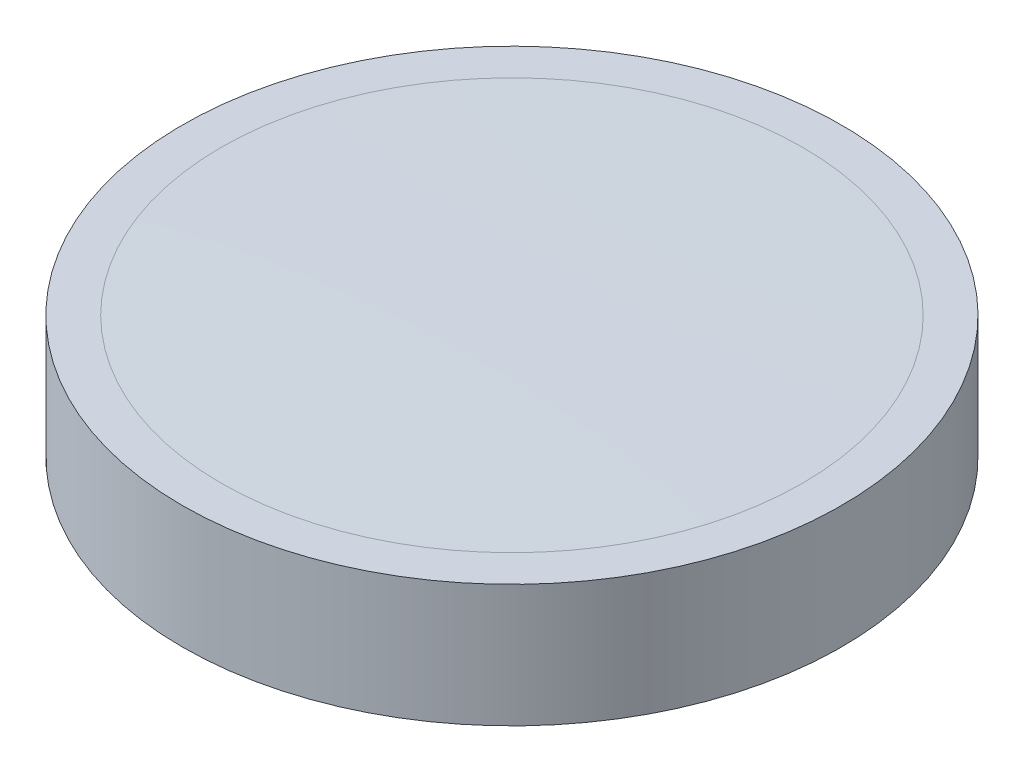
ISO-10303-21;
HEADER;
FILE_DESCRIPTION(('STEP AP214'),'2;1');
FILE_NAME('part.step','',(''),(''),'','','');
FILE_SCHEMA(('AUTOMOTIVE_DESIGN { 1 0 10303 214 1 1 1 1 }'));
ENDSEC;
DATA;
#1=APPLICATION_CONTEXT('core data for automotive mechanical design processes');
#2=APPLICATION_PROTOCOL_DEFINITION('international standard','automotive_design',2000,#1);
#3=PRODUCT_CONTEXT('',#1,'mechanical');
#4=PRODUCT('Part','Part','',(#3));
#5=PRODUCT_RELATED_PRODUCT_CATEGORY('part','',(#4));
#6=PRODUCT_DEFINITION_FORMATION('','',#4);
#7=PRODUCT_DEFINITION_CONTEXT('part definition',#1,'design');
#8=PRODUCT_DEFINITION('design','',#6,#7);
#9=PRODUCT_DEFINITION_SHAPE('','',#8);
#10=(LENGTH_UNIT() NAMED_UNIT(*) SI_UNIT(.MILLI.,.METRE.));
#11=(NAMED_UNIT(*) PLANE_ANGLE_UNIT() SI_UNIT($,.RADIAN.));
#12=(NAMED_UNIT(*) SI_UNIT($,.STERADIAN.) SOLID_ANGLE_UNIT());
#13=UNCERTAINTY_MEASURE_WITH_UNIT(LENGTH_MEASURE(1.E-05),#10,'distance_accuracy_value','');
#14=(GEOMETRIC_REPRESENTATION_CONTEXT(3) GLOBAL_UNCERTAINTY_ASSIGNED_CONTEXT((#13)) GLOBAL_UNIT_ASSIGNED_CONTEXT((#10,
#11,#12)) REPRESENTATION_CONTEXT('',''));
#15=CARTESIAN_POINT('',(0.,0.,0.));
#16=DIRECTION('',(0.,0.,1.));
#17=DIRECTION('',(1.,0.,0.));
#18=AXIS2_PLACEMENT_3D('',#15,#16,#17);
#19=CARTESIAN_POINT('',(-3.93,16.1,30.));
#20=CARTESIAN_POINT('',(-3.93,16.1,29.98015872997));
#21=CARTESIAN_POINT('',(-3.93,16.09999446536,29.94047618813));
#22=CARTESIAN_POINT('',(-3.93,16.09996956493,29.88095237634));
#23=CARTESIAN_POINT('',(-3.93,16.09992808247,29.82142856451));
#24=CARTESIAN_POINT('',(-3.93,16.0998700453,29.76190475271));
#25=CARTESIAN_POINT('',(-3.93,16.09979549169,29.70238094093));
#26=CARTESIAN_POINT('',(-3.93,16.09970447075,29.64285712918));
#27=CARTESIAN_POINT('',(-3.93,16.09959704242,29.58333331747));
#28=CARTESIAN_POINT('',(-3.93,16.09947327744,29.5238095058));
#29=CARTESIAN_POINT('',(-3.93,16.09933325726,29.46428569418));
#30=CARTESIAN_POINT('',(-3.93,16.09917707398,29.40476188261));
#31=CARTESIAN_POINT('',(-3.93,16.09900483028,29.3452380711));
#32=CARTESIAN_POINT('',(-3.93,16.09881663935,29.28571425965));
#33=CARTESIAN_POINT('',(-3.93,16.09861262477,29.22619044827));
#34=CARTESIAN_POINT('',(-3.93,16.09839292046,29.16666663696));
#35=CARTESIAN_POINT('',(-3.93,16.09815767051,29.10714282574));
#36=CARTESIAN_POINT('',(-3.93,16.09790702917,29.04761901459));
#37=CARTESIAN_POINT('',(-3.93,16.09764116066,28.98809520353));
#38=CARTESIAN_POINT('',(-3.93,16.0973602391,28.92857139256));
#39=CARTESIAN_POINT('',(-3.93,16.09706444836,28.86904758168));
#40=CARTESIAN_POINT('',(-3.93,16.09675398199,28.8095237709));
#41=CARTESIAN_POINT('',(-3.93,16.09642904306,28.74999996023));
#42=CARTESIAN_POINT('',(-3.93,16.09608984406,28.69047614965));
#43=CARTESIAN_POINT('',(-3.93,16.09573660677,28.63095233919));
#44=CARTESIAN_POINT('',(-3.93,16.09536956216,28.57142852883));
#45=CARTESIAN_POINT('',(-3.93,16.09498895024,28.51190471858));
#46=CARTESIAN_POINT('',(-3.93,16.09459501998,28.45238090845));
#47=CARTESIAN_POINT('',(-3.93,16.09418802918,28.39285709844));
#48=CARTESIAN_POINT('',(-3.93,16.09376824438,28.33333328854));
#49=CARTESIAN_POINT('',(-3.93,16.09333594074,28.27380947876));
#50=CARTESIAN_POINT('',(-3.93,16.09289140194,28.2142856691));
#51=CARTESIAN_POINT('',(-3.93,16.0924349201,28.15476185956));
#52=CARTESIAN_POINT('',(-3.93,16.09196679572,28.09523805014));
#53=CARTESIAN_POINT('',(-3.93,16.09148733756,28.03571424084));
#54=CARTESIAN_POINT('',(-3.93,16.09099686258,27.97619043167));
#55=CARTESIAN_POINT('',(-3.93,16.09049569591,27.91666662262));
#56=CARTESIAN_POINT('',(-3.93,16.08998417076,27.85714281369));
#57=CARTESIAN_POINT('',(-3.93,16.08946262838,27.79761900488));
#58=CARTESIAN_POINT('',(-3.93,16.08893141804,27.73809519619));
#59=CARTESIAN_POINT('',(-3.93,16.08839089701,27.67857138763));
#60=CARTESIAN_POINT('',(-3.93,16.08784143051,27.61904757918));
#61=CARTESIAN_POINT('',(-3.93,16.08728339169,27.55952377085));
#62=CARTESIAN_POINT('',(-3.93,16.08671716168,27.49999996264));
#63=CARTESIAN_POINT('',(-3.93,16.08614312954,27.44047615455));
#64=CARTESIAN_POINT('',(-3.93,16.08556169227,27.38095234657));
#65=CARTESIAN_POINT('',(-3.93,16.08497325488,27.32142853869));
#66=CARTESIAN_POINT('',(-3.93,16.08437823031,27.26190473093));
#67=CARTESIAN_POINT('',(-3.93,16.08377703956,27.20238092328));
#68=CARTESIAN_POINT('',(-3.93,16.08317011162,27.14285711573));
#69=CARTESIAN_POINT('',(-3.93,16.08255788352,27.08333330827));
#70=CARTESIAN_POINT('',(-3.93,16.08194080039,27.02380950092));
#71=CARTESIAN_POINT('',(-3.93,16.08131931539,26.96428569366));
#72=CARTESIAN_POINT('',(-3.93,16.08069388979,26.90476188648));
#73=CARTESIAN_POINT('',(-3.93,16.08006499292,26.84523807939));
#74=CARTESIAN_POINT('',(-3.93,16.07943310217,26.78571427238));
#75=CARTESIAN_POINT('',(-3.93,16.07879870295,26.72619046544));
#76=CARTESIAN_POINT('',(-3.93,16.07816228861,26.66666665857));
#77=CARTESIAN_POINT('',(-3.93,16.07752436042,26.60714285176));
#78=CARTESIAN_POINT('',(-3.93,16.07688542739,26.547619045));
#79=CARTESIAN_POINT('',(-3.93,16.07624600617,26.48809523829));
#80=CARTESIAN_POINT('',(-3.93,16.07560662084,26.42857143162));
#81=CARTESIAN_POINT('',(-3.93,16.07496780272,26.36904762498));
#82=CARTESIAN_POINT('',(-3.93,16.07433009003,26.30952381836));
#83=CARTESIAN_POINT('',(-3.93,16.07363890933,26.24484194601));
#84=CARTESIAN_POINT('',(-3.93,16.07316162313,26.20000132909));
#85=CARTESIAN_POINT('',(-3.93,16.07289629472,26.17500198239));
#86=(BOUNDED_CURVE() B_SPLINE_CURVE(3,(#19,#20,#21,#22,#23,#24,#25,#26,#27,#28,#29,#30,#31,#32,
#33,#34,#35,#36,#37,#38,#39,#40,#41,#42,#43,#44,#45,#46,#47,#48,#49,#50,#51,#52,#53,#54,#55,#56,
#57,#58,#59,#60,#61,#62,#63,#64,#65,#66,#67,#68,#69,#70,#71,#72,#73,#74,#75,#76,#77,#78,#79,#80,
#81,#82,#83,#84,#85),.UNSPECIFIED.,.F.,.F.) B_SPLINE_CURVE_WITH_KNOTS((4,1,1,1,1,1,1,1,1,1,1,1,
1,1,1,1,1,1,1,1,1,1,1,1,1,1,1,1,1,1,1,1,1,1,1,1,1,1,1,1,1,1,1,1,1,1,1,1,1,1,1,1,1,1,1,1,1,1,1,1,
1,1,1,1,4),(0.,0.01556131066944,0.03112262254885,0.04668393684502,0.06224525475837,
0.07780657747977,0.09336790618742,0.1089292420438,0.1244905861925,0.1400519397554,
0.1556133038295,0.1711746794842,0.1867360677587,0.2022974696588,0.2178588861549,0.2334203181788,
0.248981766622,0.2645432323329,0.2801047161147,0.2956662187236,0.3112277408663,0.3267892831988,
0.3423508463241,0.357912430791,0.3734740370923,0.3890356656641,0.4045973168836,0.4201589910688,
0.4357206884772,0.451282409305,0.4668441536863,0.4824059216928,0.4979677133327,0.5135295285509,
0.5290913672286,0.5446532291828,0.5602151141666,0.5757770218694,0.5913389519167,0.6069009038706,
0.6224628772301,0.6380248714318,0.6535868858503,0.6691489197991,0.6847109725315,0.7002730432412,
0.715835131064,0.7313972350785,0.7469593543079,0.7625214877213,0.7780836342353,0.7936457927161,
0.8092079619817,0.8247701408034,0.8403323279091,0.8558945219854,0.8714567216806,0.8870189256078,
0.9025811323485,0.918143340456,0.9337055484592,0.9492677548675,0.9648299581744,0.9803921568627,
1.),.UNSPECIFIED.) CURVE() GEOMETRIC_REPRESENTATION_ITEM() RATIONAL_B_SPLINE_CURVE((1.,1.,1.,1.,
1.,1.,1.,1.,1.,1.,1.,1.,1.,1.,1.,1.,1.,1.,1.,1.,1.,1.,1.,1.,1.,1.,1.,1.,1.,1.,1.,1.,1.,1.,1.,1.,
1.,1.,1.,1.,1.,1.,1.,1.,1.,1.,1.,1.,1.,1.,1.,1.,1.,1.,1.,1.,1.,1.,1.,1.,1.,1.,1.,1.,1.,1.,1.)) REPRESENTATION_ITEM(''));
#87=CARTESIAN_POINT('',(-3.93,16.1,30.));
#88=DIRECTION('',(0.,1.,0.));
#89=AXIS1_PLACEMENT('',#87,#88);
#90=SURFACE_OF_REVOLUTION('',#86,#89);
#91=CARTESIAN_POINT('',(-3.93,16.1,30.));
#92=VERTEX_POINT('',#91);
#93=VERTEX_LOOP('',#92);
#94=FACE_BOUND('',#93,.T.);
#95=CARTESIAN_POINT('',(-3.93,16.0736943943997,30.));
#96=DIRECTION('',(0.,1.,0.));
#97=DIRECTION('',(0.,0.,1.));
#98=AXIS2_PLACEMENT_3D('',#95,#96,#97);
#99=CIRCLE('',#98,3.75);
#100=CARTESIAN_POINT('',(-3.93,16.0736943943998,26.25));
#101=VERTEX_POINT('',#100);
#102=CARTESIAN_POINT('',(-3.93000000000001,16.0736943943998,33.75));
#103=VERTEX_POINT('',#102);
#104=EDGE_CURVE('E45',#101,#103,#99,.F.);
#105=ORIENTED_EDGE('',*,*,#104,.F.);
#106=CARTESIAN_POINT('',(-3.93,16.0736943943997,30.));
#107=DIRECTION('',(0.,1.,0.));
#108=DIRECTION('',(0.,0.,-1.));
#109=AXIS2_PLACEMENT_3D('',#106,#107,#108);
#110=CIRCLE('',#109,3.75);
#111=EDGE_CURVE('E48',#103,#101,#110,.F.);
#112=ORIENTED_EDGE('',*,*,#111,.F.);
#113=EDGE_LOOP('',(#105,#112));
#114=FACE_BOUND('',#113,.T.);
#115=ADVANCED_FACE('F17',(#94,#114),#90,.F.);
#116=CARTESIAN_POINT('',(-3.93,16.0736943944,23.7033));
#117=DIRECTION('',(0.,1.,0.));
#118=DIRECTION('',(0.,0.,1.));
#119=AXIS2_PLACEMENT_3D('',#116,#117,#118);
#120=PLANE('',#119);
#121=ORIENTED_EDGE('',*,*,#111,.T.);
#122=ORIENTED_EDGE('',*,*,#104,.T.);
#123=EDGE_LOOP('',(#121,#122));
#124=FACE_BOUND('',#123,.T.);
#125=CARTESIAN_POINT('',(-3.93,16.0736943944,30.));
#126=DIRECTION('',(0.,1.,0.));
#127=DIRECTION('',(0.,0.,1.));
#128=AXIS2_PLACEMENT_3D('',#125,#126,#127);
#129=CIRCLE('',#128,4.25);
#130=CARTESIAN_POINT('',(-3.93,16.0736943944,34.25));
#131=VERTEX_POINT('',#130);
#132=EDGE_CURVE('E51',#131,#131,#129,.F.);
#133=ORIENTED_EDGE('',*,*,#132,.F.);
#134=EDGE_LOOP('',(#133));
#135=FACE_BOUND('',#134,.T.);
#136=ADVANCED_FACE('F43',(#124,#135),#120,.T.);
#137=CARTESIAN_POINT('',(-3.93,14.4788783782,30.));
#138=DIRECTION('',(0.,1.,0.));
#139=DIRECTION('',(0.,0.,1.));
#140=AXIS2_PLACEMENT_3D('',#137,#138,#139);
#141=CYLINDRICAL_SURFACE('',#140,4.25);
#142=CARTESIAN_POINT('',(-3.93,14.49276109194,30.));
#143=DIRECTION('',(0.,1.,0.));
#144=DIRECTION('',(0.,0.,1.));
#145=AXIS2_PLACEMENT_3D('',#142,#143,#144);
#146=CIRCLE('',#145,4.25);
#147=CARTESIAN_POINT('',(-3.93,14.49276109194,34.25));
#148=VERTEX_POINT('',#147);
#149=EDGE_CURVE('E29',#148,#148,#146,.F.);
#150=ORIENTED_EDGE('',*,*,#149,.F.);
#151=EDGE_LOOP('',(#150));
#152=FACE_BOUND('',#151,.T.);
#153=ORIENTED_EDGE('',*,*,#132,.T.);
#154=EDGE_LOOP('',(#153));
#155=FACE_BOUND('',#154,.T.);
#156=ADVANCED_FACE('F71',(#152,#155),#141,.T.);
#157=CARTESIAN_POINT('',(-3.93,14.49276109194,36.4217));
#158=DIRECTION('',(0.,-1.,0.));
#159=DIRECTION('',(0.,0.,-1.));
#160=AXIS2_PLACEMENT_3D('',#157,#158,#159);
#161=PLANE('',#160);
#162=CARTESIAN_POINT('',(-3.93,14.49276109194,30.));
#163=DIRECTION('',(0.,-1.,0.));
#164=DIRECTION('',(0.,0.,-1.));
#165=AXIS2_PLACEMENT_3D('',#162,#163,#164);
#166=CIRCLE('',#165,4.00000000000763);
#167=CARTESIAN_POINT('',(-3.93,14.49276109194,25.9999999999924));
#168=VERTEX_POINT('',#167);
#169=EDGE_CURVE('E11',#168,#168,#166,.T.);
#170=ORIENTED_EDGE('',*,*,#169,.F.);
#171=EDGE_LOOP('',(#170));
#172=FACE_BOUND('',#171,.T.);
#173=ORIENTED_EDGE('',*,*,#149,.T.);
#174=EDGE_LOOP('',(#173));
#175=FACE_BOUND('',#174,.T.);
#176=ADVANCED_FACE('F88',(#172,#175),#161,.T.);
#177=CARTESIAN_POINT('',(-3.93,13.6,30.));
#178=CARTESIAN_POINT('',(-3.93,13.6,30.02116414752));
#179=CARTESIAN_POINT('',(-3.93,13.60014627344,30.06349359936));
#180=CARTESIAN_POINT('',(-3.93,13.60080451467,30.1269871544));
#181=CARTESIAN_POINT('',(-3.93,13.60190163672,30.19048074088));
#182=CARTESIAN_POINT('',(-3.93,13.60343771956,30.25397431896));
#183=CARTESIAN_POINT('',(-3.93,13.60541287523,30.31746789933));
#184=CARTESIAN_POINT('',(-3.93,13.6078272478,30.38096147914));
#185=CARTESIAN_POINT('',(-3.93,13.61068101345,30.44445505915));
#186=CARTESIAN_POINT('',(-3.93,13.61397438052,30.50794863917));
#187=CARTESIAN_POINT('',(-3.93,13.61770758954,30.57144221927));
#188=CARTESIAN_POINT('',(-3.93,13.62188091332,30.63493579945));
#189=CARTESIAN_POINT('',(-3.93,13.62649465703,30.6984293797));
#190=CARTESIAN_POINT('',(-3.93,13.63154915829,30.76192296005));
#191=CARTESIAN_POINT('',(-3.93,13.63704478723,30.82541654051));
#192=CARTESIAN_POINT('',(-3.93,13.64298194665,30.88891012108));
#193=CARTESIAN_POINT('',(-3.93,13.64936107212,30.95240370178));
#194=CARTESIAN_POINT('',(-3.93,13.65618263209,31.01589728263));
#195=CARTESIAN_POINT('',(-3.93,13.66344712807,31.07939086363));
#196=CARTESIAN_POINT('',(-3.93,13.67115509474,31.1428844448));
#197=CARTESIAN_POINT('',(-3.93,13.67930710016,31.20637802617));
#198=CARTESIAN_POINT('',(-3.93,13.68790374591,31.26987160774));
#199=CARTESIAN_POINT('',(-3.93,13.69694566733,31.33336518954));
#200=CARTESIAN_POINT('',(-3.93,13.70643353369,31.39685877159));
#201=CARTESIAN_POINT('',(-3.93,13.71636804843,31.46035235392));
#202=CARTESIAN_POINT('',(-3.93,13.7267499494,31.52384593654));
#203=CARTESIAN_POINT('',(-3.93,13.73758000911,31.58733951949));
#204=CARTESIAN_POINT('',(-3.93,13.74885903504,31.6508331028));
#205=CARTESIAN_POINT('',(-3.93,13.76058786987,31.7143266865));
#206=CARTESIAN_POINT('',(-3.93,13.77276739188,31.77782027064));
#207=CARTESIAN_POINT('',(-3.93,13.78539851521,31.84131385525));
#208=CARTESIAN_POINT('',(-3.93,13.79848219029,31.90480744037));
#209=CARTESIAN_POINT('',(-3.93,13.81201940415,31.96830102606));
#210=CARTESIAN_POINT('',(-3.93,13.8260111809,32.03179461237));
#211=CARTESIAN_POINT('',(-3.93,13.84045858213,32.09528819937));
#212=CARTESIAN_POINT('',(-3.93,13.85536270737,32.1587817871));
#213=CARTESIAN_POINT('',(-3.93,13.87072469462,32.22227537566));
#214=CARTESIAN_POINT('',(-3.93,13.88654572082,32.28576896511));
#215=CARTESIAN_POINT('',(-3.93,13.90282700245,32.34926255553));
#216=CARTESIAN_POINT('',(-3.93,13.91956979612,32.41275614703));
#217=CARTESIAN_POINT('',(-3.93,13.93677539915,32.47624973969));
#218=CARTESIAN_POINT('',(-3.93,13.95444515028,32.53974333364));
#219=CARTESIAN_POINT('',(-3.93,13.97258043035,32.60323692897));
#220=CARTESIAN_POINT('',(-3.93,13.99118266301,32.66673052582));
#221=CARTESIAN_POINT('',(-3.93,14.01025331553,32.73022412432));
#222=CARTESIAN_POINT('',(-3.93,14.0297938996,32.79371772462));
#223=CARTESIAN_POINT('',(-3.93,14.04980597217,32.85721132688));
#224=CARTESIAN_POINT('',(-3.93,14.07029113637,32.92070493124));
#225=CARTESIAN_POINT('',(-3.93,14.09125104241,32.9841985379));
#226=CARTESIAN_POINT('',(-3.93,14.11268738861,33.04769214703));
#227=CARTESIAN_POINT('',(-3.93,14.13460192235,33.11118575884));
#228=CARTESIAN_POINT('',(-3.93,14.15699644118,33.17467937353));
#229=CARTESIAN_POINT('',(-3.93,14.1798727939,33.23817299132));
#230=CARTESIAN_POINT('',(-3.93,14.20323288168,33.30166661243));
#231=CARTESIAN_POINT('',(-3.93,14.22707865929,33.36516023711));
#232=CARTESIAN_POINT('',(-3.93,14.2514121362,33.4286538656));
#233=CARTESIAN_POINT('',(-3.93,14.27623537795,33.49214749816));
#234=CARTESIAN_POINT('',(-3.93,14.3015505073,33.55564113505));
#235=CARTESIAN_POINT('',(-3.93,14.32735970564,33.61913477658));
#236=CARTESIAN_POINT('',(-3.93,14.35366521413,33.68262842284));
#237=CARTESIAN_POINT('',(-3.93,14.38046933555,33.74612207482));
#238=CARTESIAN_POINT('',(-3.93,14.40777443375,33.80961573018));
#239=CARTESIAN_POINT('',(-3.93,14.43558294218,33.87310939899));
#240=CARTESIAN_POINT('',(-3.93,14.4638973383,33.93660304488));
#241=CARTESIAN_POINT('',(-3.93,14.49446544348,34.00394128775));
#242=CARTESIAN_POINT('',(-3.93,14.51578974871,34.05002492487));
#243=CARTESIAN_POINT('',(-3.93,14.52745092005,34.07496884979));
#244=(BOUNDED_CURVE() B_SPLINE_CURVE(3,(#177,#178,#179,#180,#181,#182,#183,#184,#185,#186,#187,
#188,#189,#190,#191,#192,#193,#194,#195,#196,#197,#198,#199,#200,#201,#202,#203,#204,#205,#206,
#207,#208,#209,#210,#211,#212,#213,#214,#215,#216,#217,#218,#219,#220,#221,#222,#223,#224,#225,
#226,#227,#228,#229,#230,#231,#232,#233,#234,#235,#236,#237,#238,#239,#240,#241,#242,#243),
.UNSPECIFIED.,.F.,.F.) B_SPLINE_CURVE_WITH_KNOTS((4,1,1,1,1,1,1,1,1,1,1,1,1,1,1,1,1,1,1,1,1,1,1,
1,1,1,1,1,1,1,1,1,1,1,1,1,1,1,1,1,1,1,1,1,1,1,1,1,1,1,1,1,1,1,1,1,1,1,1,1,1,1,1,1,4),(0.,
0.01507085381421,0.03014242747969,0.04521544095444,0.06029061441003,0.07536866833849,
0.09045032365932,0.1055363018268,0.1206273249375,0.1357241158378,0.1508273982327,
0.1659378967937,0.1810563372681,0.1961834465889,0.2113199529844,0.2264665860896,0.2416240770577,
0.2567931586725,0.2719745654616,0.2871690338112,0.3023773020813,0.3176001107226,0.3328382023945,
0.3480923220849,0.3633632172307,0.3786516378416,0.3939583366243,0.4092840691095,0.4246295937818,
0.4399956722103,0.4553830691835,0.4707925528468,0.4862248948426,0.501680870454,0.5171612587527,
0.5326668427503,0.5481984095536,0.5637567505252,0.5793426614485,0.5949569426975,0.6106003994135,
0.6262738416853,0.6419780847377,0.6577139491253,0.6734822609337,0.6892838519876,0.7051195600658,
0.720990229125,0.7368967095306,0.7528398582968,0.7688205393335,0.7848396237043,0.8008979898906,
0.8169965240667,0.8331361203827,0.8493176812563,0.8655421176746,0.8818103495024,0.8981233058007,
0.9144819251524,0.9308871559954,0.9473399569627,0.963841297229,0.9803921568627,1.),
.UNSPECIFIED.) CURVE() GEOMETRIC_REPRESENTATION_ITEM() RATIONAL_B_SPLINE_CURVE((1.,1.,1.,1.,1.,
1.,1.,1.,1.,1.,1.,1.,1.,1.,1.,1.,1.,1.,1.,1.,1.,1.,1.,1.,1.,1.,1.,1.,1.,1.,1.,1.,1.,1.,1.,1.,1.,
1.,1.,1.,1.,1.,1.,1.,1.,1.,1.,1.,1.,1.,1.,1.,1.,1.,1.,1.,1.,1.,1.,1.,1.,1.,1.,1.,1.,1.,1.)) REPRESENTATION_ITEM(''));
#245=CARTESIAN_POINT('',(-3.93,13.6,30.));
#246=DIRECTION('',(0.,-1.,0.));
#247=AXIS1_PLACEMENT('',#245,#246);
#248=SURFACE_OF_REVOLUTION('',#244,#247);
#249=CARTESIAN_POINT('',(-3.93,13.6,30.));
#250=VERTEX_POINT('',#249);
#251=VERTEX_LOOP('',#250);
#252=FACE_BOUND('',#251,.T.);
#253=ORIENTED_EDGE('',*,*,#169,.T.);
#254=EDGE_LOOP('',(#253));
#255=FACE_BOUND('',#254,.T.);
#256=ADVANCED_FACE('F92',(#252,#255),#248,.F.);
#257=CLOSED_SHELL('',(#115,#136,#156,#176,#256));
#258=MANIFOLD_SOLID_BREP('B1',#257);
#259=ADVANCED_BREP_SHAPE_REPRESENTATION('',(#18,#258),#14);
#260=SHAPE_DEFINITION_REPRESENTATION(#9,#259);
ENDSEC;
END-ISO-10303-21;
